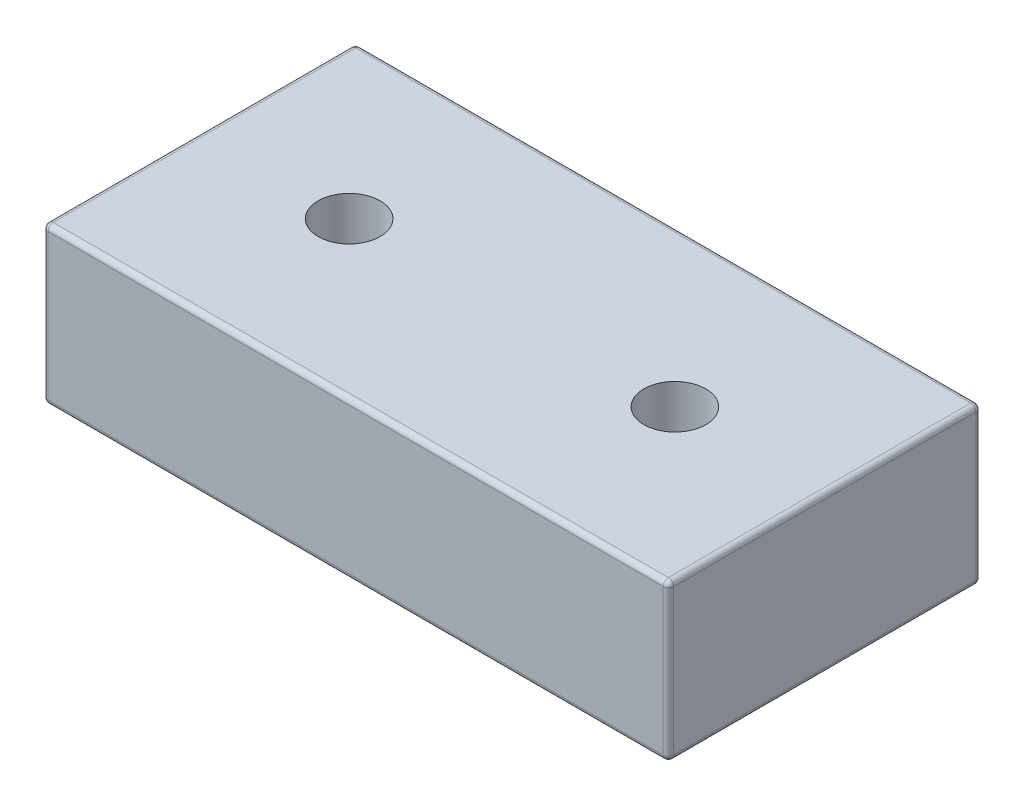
ISO-10303-21;
HEADER;
FILE_DESCRIPTION(('STEP AP214'),'2;1');
FILE_NAME('part.step','',(''),(''),'','','');
FILE_SCHEMA(('AUTOMOTIVE_DESIGN { 1 0 10303 214 1 1 1 1 }'));
ENDSEC;
DATA;
#1=APPLICATION_CONTEXT('core data for automotive mechanical design processes');
#2=APPLICATION_PROTOCOL_DEFINITION('international standard','automotive_design',2000,#1);
#3=PRODUCT_CONTEXT('',#1,'mechanical');
#4=PRODUCT('Part','Part','',(#3));
#5=PRODUCT_RELATED_PRODUCT_CATEGORY('part','',(#4));
#6=PRODUCT_DEFINITION_FORMATION('','',#4);
#7=PRODUCT_DEFINITION_CONTEXT('part definition',#1,'design');
#8=PRODUCT_DEFINITION('design','',#6,#7);
#9=PRODUCT_DEFINITION_SHAPE('','',#8);
#10=(LENGTH_UNIT() NAMED_UNIT(*) SI_UNIT(.MILLI.,.METRE.));
#11=(NAMED_UNIT(*) PLANE_ANGLE_UNIT() SI_UNIT($,.RADIAN.));
#12=(NAMED_UNIT(*) SI_UNIT($,.STERADIAN.) SOLID_ANGLE_UNIT());
#13=UNCERTAINTY_MEASURE_WITH_UNIT(LENGTH_MEASURE(1.E-05),#10,'distance_accuracy_value','');
#14=(GEOMETRIC_REPRESENTATION_CONTEXT(3) GLOBAL_UNCERTAINTY_ASSIGNED_CONTEXT((#13)) GLOBAL_UNIT_ASSIGNED_CONTEXT((#10,
#11,#12)) REPRESENTATION_CONTEXT('',''));
#15=CARTESIAN_POINT('',(0.,0.,0.));
#16=DIRECTION('',(0.,0.,1.));
#17=DIRECTION('',(1.,0.,0.));
#18=AXIS2_PLACEMENT_3D('',#15,#16,#17);
#19=CARTESIAN_POINT('',(304.8,76.2,-152.4));
#20=DIRECTION('',(-1.,0.,0.));
#21=DIRECTION('',(0.,0.,1.));
#22=AXIS2_PLACEMENT_3D('',#19,#20,#21);
#23=PLANE('',#22);
#24=DIRECTION('',(0.,0.,-1.));
#25=VECTOR('',#24,1.);
#26=CARTESIAN_POINT('',(304.8,-71.12,-152.4));
#27=LINE('',#26,#25);
#28=CARTESIAN_POINT('',(304.8,-71.12,147.32));
#29=VERTEX_POINT('',#28);
#30=CARTESIAN_POINT('',(304.8,-71.12,-147.32));
#31=VERTEX_POINT('',#30);
#32=EDGE_CURVE('E199',#29,#31,#27,.T.);
#33=ORIENTED_EDGE('',*,*,#32,.T.);
#34=DIRECTION('',(0.,-1.,0.));
#35=VECTOR('',#34,1.);
#36=CARTESIAN_POINT('',(304.8,76.2,-147.32));
#37=LINE('',#36,#35);
#38=CARTESIAN_POINT('',(304.8,71.12,-147.32));
#39=VERTEX_POINT('',#38);
#40=EDGE_CURVE('E45',#31,#39,#37,.F.);
#41=ORIENTED_EDGE('',*,*,#40,.T.);
#42=DIRECTION('',(0.,0.,-1.));
#43=VECTOR('',#42,1.);
#44=CARTESIAN_POINT('',(304.8,71.12,-152.4));
#45=LINE('',#44,#43);
#46=CARTESIAN_POINT('',(304.8,71.12,147.32));
#47=VERTEX_POINT('',#46);
#48=EDGE_CURVE('E174',#39,#47,#45,.F.);
#49=ORIENTED_EDGE('',*,*,#48,.T.);
#50=DIRECTION('',(0.,-1.,0.));
#51=VECTOR('',#50,1.);
#52=CARTESIAN_POINT('',(304.8,76.2,147.32));
#53=LINE('',#52,#51);
#54=EDGE_CURVE('E250',#47,#29,#53,.T.);
#55=ORIENTED_EDGE('',*,*,#54,.T.);
#56=EDGE_LOOP('',(#33,#41,#49,#55));
#57=FACE_BOUND('',#56,.T.);
#58=ADVANCED_FACE('F36',(#57),#23,.F.);
#59=CARTESIAN_POINT('',(304.8,76.2,-152.4));
#60=DIRECTION('',(0.,0.,1.));
#61=DIRECTION('',(1.,0.,0.));
#62=AXIS2_PLACEMENT_3D('',#59,#60,#61);
#63=PLANE('',#62);
#64=DIRECTION('',(-1.,0.,0.));
#65=VECTOR('',#64,1.);
#66=CARTESIAN_POINT('',(304.8,71.12,-152.4));
#67=LINE('',#66,#65);
#68=CARTESIAN_POINT('',(-299.72,71.12,-152.4));
#69=VERTEX_POINT('',#68);
#70=CARTESIAN_POINT('',(299.72,71.12,-152.4));
#71=VERTEX_POINT('',#70);
#72=EDGE_CURVE('E148',#69,#71,#67,.F.);
#73=ORIENTED_EDGE('',*,*,#72,.T.);
#74=DIRECTION('',(0.,-1.,0.));
#75=VECTOR('',#74,1.);
#76=CARTESIAN_POINT('',(299.72,76.2,-152.4));
#77=LINE('',#76,#75);
#78=CARTESIAN_POINT('',(299.72,-71.12,-152.4));
#79=VERTEX_POINT('',#78);
#80=EDGE_CURVE('E248',#71,#79,#77,.T.);
#81=ORIENTED_EDGE('',*,*,#80,.T.);
#82=DIRECTION('',(-1.,0.,0.));
#83=VECTOR('',#82,1.);
#84=CARTESIAN_POINT('',(-304.8,-71.12,-152.4));
#85=LINE('',#84,#83);
#86=CARTESIAN_POINT('',(-299.72,-71.12,-152.4));
#87=VERTEX_POINT('',#86);
#88=EDGE_CURVE('E149',#79,#87,#85,.T.);
#89=ORIENTED_EDGE('',*,*,#88,.T.);
#90=DIRECTION('',(0.,-1.,0.));
#91=VECTOR('',#90,1.);
#92=CARTESIAN_POINT('',(-299.72,76.2,-152.4));
#93=LINE('',#92,#91);
#94=EDGE_CURVE('E209',#87,#69,#93,.F.);
#95=ORIENTED_EDGE('',*,*,#94,.T.);
#96=EDGE_LOOP('',(#73,#81,#89,#95));
#97=FACE_BOUND('',#96,.T.);
#98=ADVANCED_FACE('F342',(#97),#63,.F.);
#99=CARTESIAN_POINT('',(-304.8,76.2,-152.4));
#100=DIRECTION('',(1.,0.,0.));
#101=DIRECTION('',(0.,0.,-1.));
#102=AXIS2_PLACEMENT_3D('',#99,#100,#101);
#103=PLANE('',#102);
#104=DIRECTION('',(0.,0.,1.));
#105=VECTOR('',#104,1.);
#106=CARTESIAN_POINT('',(-304.8,-71.12,152.4));
#107=LINE('',#106,#105);
#108=CARTESIAN_POINT('',(-304.8,-71.12,-147.32));
#109=VERTEX_POINT('',#108);
#110=CARTESIAN_POINT('',(-304.8,-71.12,147.32));
#111=VERTEX_POINT('',#110);
#112=EDGE_CURVE('E182',#109,#111,#107,.T.);
#113=ORIENTED_EDGE('',*,*,#112,.T.);
#114=DIRECTION('',(0.,-1.,0.));
#115=VECTOR('',#114,1.);
#116=CARTESIAN_POINT('',(-304.8,76.2,147.32));
#117=LINE('',#116,#115);
#118=CARTESIAN_POINT('',(-304.8,71.12,147.32));
#119=VERTEX_POINT('',#118);
#120=EDGE_CURVE('E223',#111,#119,#117,.F.);
#121=ORIENTED_EDGE('',*,*,#120,.T.);
#122=DIRECTION('',(0.,0.,1.));
#123=VECTOR('',#122,1.);
#124=CARTESIAN_POINT('',(-304.8,71.12,-152.4));
#125=LINE('',#124,#123);
#126=CARTESIAN_POINT('',(-304.8,71.12,-147.32));
#127=VERTEX_POINT('',#126);
#128=EDGE_CURVE('E180',#119,#127,#125,.F.);
#129=ORIENTED_EDGE('',*,*,#128,.T.);
#130=DIRECTION('',(0.,-1.,0.));
#131=VECTOR('',#130,1.);
#132=CARTESIAN_POINT('',(-304.8,76.2,-147.32));
#133=LINE('',#132,#131);
#134=EDGE_CURVE('E207',#127,#109,#133,.T.);
#135=ORIENTED_EDGE('',*,*,#134,.T.);
#136=EDGE_LOOP('',(#113,#121,#129,#135));
#137=FACE_BOUND('',#136,.T.);
#138=ADVANCED_FACE('F310',(#137),#103,.F.);
#139=CARTESIAN_POINT('',(304.8,76.2,152.4));
#140=DIRECTION('',(0.,0.,-1.));
#141=DIRECTION('',(-1.,0.,0.));
#142=AXIS2_PLACEMENT_3D('',#139,#140,#141);
#143=PLANE('',#142);
#144=DIRECTION('',(1.,0.,0.));
#145=VECTOR('',#144,1.);
#146=CARTESIAN_POINT('',(304.8,-71.12,152.4));
#147=LINE('',#146,#145);
#148=CARTESIAN_POINT('',(-299.72,-71.12,152.4));
#149=VERTEX_POINT('',#148);
#150=CARTESIAN_POINT('',(299.72,-71.12,152.4));
#151=VERTEX_POINT('',#150);
#152=EDGE_CURVE('E197',#149,#151,#147,.T.);
#153=ORIENTED_EDGE('',*,*,#152,.T.);
#154=DIRECTION('',(0.,-1.,0.));
#155=VECTOR('',#154,1.);
#156=CARTESIAN_POINT('',(299.72,76.2,152.4));
#157=LINE('',#156,#155);
#158=CARTESIAN_POINT('',(299.72,71.12,152.4));
#159=VERTEX_POINT('',#158);
#160=EDGE_CURVE('E11',#151,#159,#157,.F.);
#161=ORIENTED_EDGE('',*,*,#160,.T.);
#162=DIRECTION('',(1.,0.,0.));
#163=VECTOR('',#162,1.);
#164=CARTESIAN_POINT('',(304.8,71.12,152.4));
#165=LINE('',#164,#163);
#166=CARTESIAN_POINT('',(-299.72,71.12,152.4));
#167=VERTEX_POINT('',#166);
#168=EDGE_CURVE('E177',#159,#167,#165,.F.);
#169=ORIENTED_EDGE('',*,*,#168,.T.);
#170=DIRECTION('',(0.,-1.,0.));
#171=VECTOR('',#170,1.);
#172=CARTESIAN_POINT('',(-299.72,76.2,152.4));
#173=LINE('',#172,#171);
#174=EDGE_CURVE('E221',#167,#149,#173,.T.);
#175=ORIENTED_EDGE('',*,*,#174,.T.);
#176=EDGE_LOOP('',(#153,#161,#169,#175));
#177=FACE_BOUND('',#176,.T.);
#178=ADVANCED_FACE('F404',(#177),#143,.F.);
#179=CARTESIAN_POINT('',(304.8,76.2,-152.4));
#180=DIRECTION('',(0.,-1.,0.));
#181=DIRECTION('',(0.,0.,-1.));
#182=AXIS2_PLACEMENT_3D('',#179,#180,#181);
#183=PLANE('',#182);
#184=CARTESIAN_POINT('',(158.75,76.2,0.));
#185=DIRECTION('',(0.,-1.,0.));
#186=DIRECTION('',(0.,0.,-1.));
#187=AXIS2_PLACEMENT_3D('',#184,#185,#186);
#188=CIRCLE('',#187,30.226);
#189=CARTESIAN_POINT('',(158.75,76.2,-30.226));
#190=VERTEX_POINT('',#189);
#191=EDGE_CURVE('E269',#190,#190,#188,.T.);
#192=ORIENTED_EDGE('',*,*,#191,.T.);
#193=EDGE_LOOP('',(#192));
#194=FACE_BOUND('',#193,.T.);
#195=CARTESIAN_POINT('',(-158.75,76.2,0.));
#196=DIRECTION('',(0.,-1.,0.));
#197=DIRECTION('',(0.,0.,-1.));
#198=AXIS2_PLACEMENT_3D('',#195,#196,#197);
#199=CIRCLE('',#198,30.226);
#200=CARTESIAN_POINT('',(-158.75,76.2,-30.226));
#201=VERTEX_POINT('',#200);
#202=EDGE_CURVE('E258',#201,#201,#199,.T.);
#203=ORIENTED_EDGE('',*,*,#202,.T.);
#204=EDGE_LOOP('',(#203));
#205=FACE_BOUND('',#204,.T.);
#206=DIRECTION('',(1.,0.,0.));
#207=VECTOR('',#206,1.);
#208=CARTESIAN_POINT('',(304.8,76.2,147.32));
#209=LINE('',#208,#207);
#210=CARTESIAN_POINT('',(-299.72,76.2,147.32));
#211=VERTEX_POINT('',#210);
#212=CARTESIAN_POINT('',(299.72,76.2,147.32));
#213=VERTEX_POINT('',#212);
#214=EDGE_CURVE('E159',#211,#213,#209,.T.);
#215=ORIENTED_EDGE('',*,*,#214,.T.);
#216=DIRECTION('',(0.,0.,-1.));
#217=VECTOR('',#216,1.);
#218=CARTESIAN_POINT('',(299.72,76.2,-152.4));
#219=LINE('',#218,#217);
#220=CARTESIAN_POINT('',(299.72,76.2,-147.32));
#221=VERTEX_POINT('',#220);
#222=EDGE_CURVE('E158',#213,#221,#219,.T.);
#223=ORIENTED_EDGE('',*,*,#222,.T.);
#224=DIRECTION('',(-1.,0.,0.));
#225=VECTOR('',#224,1.);
#226=CARTESIAN_POINT('',(304.8,76.2,-147.32));
#227=LINE('',#226,#225);
#228=CARTESIAN_POINT('',(-299.72,76.2,-147.32));
#229=VERTEX_POINT('',#228);
#230=EDGE_CURVE('E145',#221,#229,#227,.T.);
#231=ORIENTED_EDGE('',*,*,#230,.T.);
#232=DIRECTION('',(0.,0.,1.));
#233=VECTOR('',#232,1.);
#234=CARTESIAN_POINT('',(-299.72,76.2,-152.4));
#235=LINE('',#234,#233);
#236=EDGE_CURVE('E155',#229,#211,#235,.T.);
#237=ORIENTED_EDGE('',*,*,#236,.T.);
#238=EDGE_LOOP('',(#215,#223,#231,#237));
#239=FACE_BOUND('',#238,.T.);
#240=ADVANCED_FACE('F154',(#194,#205,#239),#183,.F.);
#241=CARTESIAN_POINT('',(304.8,-76.2,-152.4));
#242=DIRECTION('',(0.,-1.,0.));
#243=DIRECTION('',(0.,0.,-1.));
#244=AXIS2_PLACEMENT_3D('',#241,#242,#243);
#245=PLANE('',#244);
#246=CARTESIAN_POINT('',(158.75,-76.2,0.));
#247=DIRECTION('',(0.,-1.,0.));
#248=DIRECTION('',(0.,0.,-1.));
#249=AXIS2_PLACEMENT_3D('',#246,#247,#248);
#250=CIRCLE('',#249,30.226);
#251=CARTESIAN_POINT('',(158.75,-76.2,-30.226));
#252=VERTEX_POINT('',#251);
#253=EDGE_CURVE('E271',#252,#252,#250,.T.);
#254=ORIENTED_EDGE('',*,*,#253,.F.);
#255=EDGE_LOOP('',(#254));
#256=FACE_BOUND('',#255,.T.);
#257=CARTESIAN_POINT('',(-158.75,-76.2,0.));
#258=DIRECTION('',(0.,-1.,0.));
#259=DIRECTION('',(0.,0.,-1.));
#260=AXIS2_PLACEMENT_3D('',#257,#258,#259);
#261=CIRCLE('',#260,30.226);
#262=CARTESIAN_POINT('',(-158.75,-76.2,-30.226));
#263=VERTEX_POINT('',#262);
#264=EDGE_CURVE('E169',#263,#263,#261,.T.);
#265=ORIENTED_EDGE('',*,*,#264,.F.);
#266=EDGE_LOOP('',(#265));
#267=FACE_BOUND('',#266,.T.);
#268=DIRECTION('',(1.,0.,0.));
#269=VECTOR('',#268,1.);
#270=CARTESIAN_POINT('',(-304.8,-76.2,147.32));
#271=LINE('',#270,#269);
#272=CARTESIAN_POINT('',(299.72,-76.2,147.32));
#273=VERTEX_POINT('',#272);
#274=CARTESIAN_POINT('',(-299.72,-76.2,147.32));
#275=VERTEX_POINT('',#274);
#276=EDGE_CURVE('E191',#273,#275,#271,.F.);
#277=ORIENTED_EDGE('',*,*,#276,.T.);
#278=DIRECTION('',(0.,0.,1.));
#279=VECTOR('',#278,1.);
#280=CARTESIAN_POINT('',(-299.72,-76.2,-152.4));
#281=LINE('',#280,#279);
#282=CARTESIAN_POINT('',(-299.72,-76.2,-147.32));
#283=VERTEX_POINT('',#282);
#284=EDGE_CURVE('E194',#275,#283,#281,.F.);
#285=ORIENTED_EDGE('',*,*,#284,.T.);
#286=DIRECTION('',(-1.,0.,0.));
#287=VECTOR('',#286,1.);
#288=CARTESIAN_POINT('',(304.8,-76.2,-147.32));
#289=LINE('',#288,#287);
#290=CARTESIAN_POINT('',(299.72,-76.2,-147.32));
#291=VERTEX_POINT('',#290);
#292=EDGE_CURVE('E185',#283,#291,#289,.F.);
#293=ORIENTED_EDGE('',*,*,#292,.T.);
#294=DIRECTION('',(0.,0.,-1.));
#295=VECTOR('',#294,1.);
#296=CARTESIAN_POINT('',(299.72,-76.2,152.4));
#297=LINE('',#296,#295);
#298=EDGE_CURVE('E188',#291,#273,#297,.F.);
#299=ORIENTED_EDGE('',*,*,#298,.T.);
#300=EDGE_LOOP('',(#277,#285,#293,#299));
#301=FACE_BOUND('',#300,.T.);
#302=ADVANCED_FACE('F285',(#256,#267,#301),#245,.T.);
#303=CARTESIAN_POINT('',(-299.72,71.12,-152.4));
#304=DIRECTION('',(0.,0.,1.));
#305=DIRECTION('',(1.,0.,0.));
#306=AXIS2_PLACEMENT_3D('',#303,#304,#305);
#307=CYLINDRICAL_SURFACE('',#306,5.08);
#308=ORIENTED_EDGE('',*,*,#128,.F.);
#309=CARTESIAN_POINT('',(-299.72,71.12,147.32));
#310=DIRECTION('',(0.,0.,1.));
#311=DIRECTION('',(1.,0.,0.));
#312=AXIS2_PLACEMENT_3D('',#309,#310,#311);
#313=CIRCLE('',#312,5.08);
#314=EDGE_CURVE('E163',#119,#211,#313,.F.);
#315=ORIENTED_EDGE('',*,*,#314,.T.);
#316=ORIENTED_EDGE('',*,*,#236,.F.);
#317=CARTESIAN_POINT('',(-299.72,71.12,-147.32));
#318=DIRECTION('',(0.,0.,1.));
#319=DIRECTION('',(1.,0.,0.));
#320=AXIS2_PLACEMENT_3D('',#317,#318,#319);
#321=CIRCLE('',#320,5.08);
#322=EDGE_CURVE('E128',#229,#127,#321,.T.);
#323=ORIENTED_EDGE('',*,*,#322,.T.);
#324=EDGE_LOOP('',(#308,#315,#316,#323));
#325=FACE_BOUND('',#324,.T.);
#326=ADVANCED_FACE('F161',(#325),#307,.T.);
#327=CARTESIAN_POINT('',(304.8,71.12,147.32));
#328=DIRECTION('',(1.,0.,0.));
#329=DIRECTION('',(0.,0.,-1.));
#330=AXIS2_PLACEMENT_3D('',#327,#328,#329);
#331=CYLINDRICAL_SURFACE('',#330,5.08);
#332=ORIENTED_EDGE('',*,*,#168,.F.);
#333=CARTESIAN_POINT('',(299.72,71.12,147.32));
#334=DIRECTION('',(1.,0.,0.));
#335=DIRECTION('',(0.,0.,-1.));
#336=AXIS2_PLACEMENT_3D('',#333,#334,#335);
#337=CIRCLE('',#336,5.08);
#338=EDGE_CURVE('E245',#159,#213,#337,.F.);
#339=ORIENTED_EDGE('',*,*,#338,.T.);
#340=ORIENTED_EDGE('',*,*,#214,.F.);
#341=CARTESIAN_POINT('',(-299.72,71.12,147.32));
#342=DIRECTION('',(1.,0.,0.));
#343=DIRECTION('',(0.,0.,-1.));
#344=AXIS2_PLACEMENT_3D('',#341,#342,#343);
#345=CIRCLE('',#344,5.08);
#346=EDGE_CURVE('E211',#211,#167,#345,.T.);
#347=ORIENTED_EDGE('',*,*,#346,.T.);
#348=EDGE_LOOP('',(#332,#339,#340,#347));
#349=FACE_BOUND('',#348,.T.);
#350=ADVANCED_FACE('F315',(#349),#331,.T.);
#351=CARTESIAN_POINT('',(304.8,71.12,-147.32));
#352=DIRECTION('',(-1.,0.,0.));
#353=DIRECTION('',(0.,0.,1.));
#354=AXIS2_PLACEMENT_3D('',#351,#352,#353);
#355=CYLINDRICAL_SURFACE('',#354,5.08);
#356=ORIENTED_EDGE('',*,*,#230,.F.);
#357=CARTESIAN_POINT('',(299.72,71.12,-147.32));
#358=DIRECTION('',(-1.,0.,0.));
#359=DIRECTION('',(0.,0.,1.));
#360=AXIS2_PLACEMENT_3D('',#357,#358,#359);
#361=CIRCLE('',#360,5.08);
#362=EDGE_CURVE('E237',#221,#71,#361,.T.);
#363=ORIENTED_EDGE('',*,*,#362,.T.);
#364=ORIENTED_EDGE('',*,*,#72,.F.);
#365=CARTESIAN_POINT('',(-299.72,71.12,-147.32));
#366=DIRECTION('',(-1.,0.,0.));
#367=DIRECTION('',(0.,0.,1.));
#368=AXIS2_PLACEMENT_3D('',#365,#366,#367);
#369=CIRCLE('',#368,5.08);
#370=EDGE_CURVE('E131',#69,#229,#369,.F.);
#371=ORIENTED_EDGE('',*,*,#370,.T.);
#372=EDGE_LOOP('',(#356,#363,#364,#371));
#373=FACE_BOUND('',#372,.T.);
#374=ADVANCED_FACE('F144',(#373),#355,.T.);
#375=CARTESIAN_POINT('',(299.72,71.12,-152.4));
#376=DIRECTION('',(0.,0.,-1.));
#377=DIRECTION('',(-1.,0.,0.));
#378=AXIS2_PLACEMENT_3D('',#375,#376,#377);
#379=CYLINDRICAL_SURFACE('',#378,5.08);
#380=ORIENTED_EDGE('',*,*,#48,.F.);
#381=CARTESIAN_POINT('',(299.72,71.12,-147.32));
#382=DIRECTION('',(0.,0.,-1.));
#383=DIRECTION('',(-1.,0.,0.));
#384=AXIS2_PLACEMENT_3D('',#381,#382,#383);
#385=CIRCLE('',#384,5.08);
#386=EDGE_CURVE('E234',#39,#221,#385,.F.);
#387=ORIENTED_EDGE('',*,*,#386,.T.);
#388=ORIENTED_EDGE('',*,*,#222,.F.);
#389=CARTESIAN_POINT('',(299.72,71.12,147.32));
#390=DIRECTION('',(0.,0.,-1.));
#391=DIRECTION('',(-1.,0.,0.));
#392=AXIS2_PLACEMENT_3D('',#389,#390,#391);
#393=CIRCLE('',#392,5.08);
#394=EDGE_CURVE('E225',#213,#47,#393,.T.);
#395=ORIENTED_EDGE('',*,*,#394,.T.);
#396=EDGE_LOOP('',(#380,#387,#388,#395));
#397=FACE_BOUND('',#396,.T.);
#398=ADVANCED_FACE('F318',(#397),#379,.T.);
#399=CARTESIAN_POINT('',(299.72,-71.12,-152.4));
#400=DIRECTION('',(0.,0.,1.));
#401=DIRECTION('',(1.,0.,0.));
#402=AXIS2_PLACEMENT_3D('',#399,#400,#401);
#403=CYLINDRICAL_SURFACE('',#402,5.08);
#404=ORIENTED_EDGE('',*,*,#298,.F.);
#405=CARTESIAN_POINT('',(299.72,-71.12,-147.32));
#406=DIRECTION('',(0.,0.,1.));
#407=DIRECTION('',(1.,0.,0.));
#408=AXIS2_PLACEMENT_3D('',#405,#406,#407);
#409=CIRCLE('',#408,5.08);
#410=EDGE_CURVE('E243',#291,#31,#409,.T.);
#411=ORIENTED_EDGE('',*,*,#410,.T.);
#412=ORIENTED_EDGE('',*,*,#32,.F.);
#413=CARTESIAN_POINT('',(299.72,-71.12,147.32));
#414=DIRECTION('',(0.,0.,1.));
#415=DIRECTION('',(1.,0.,0.));
#416=AXIS2_PLACEMENT_3D('',#413,#414,#415);
#417=CIRCLE('',#416,5.08);
#418=EDGE_CURVE('E241',#29,#273,#417,.F.);
#419=ORIENTED_EDGE('',*,*,#418,.T.);
#420=EDGE_LOOP('',(#404,#411,#412,#419));
#421=FACE_BOUND('',#420,.T.);
#422=ADVANCED_FACE('F329',(#421),#403,.T.);
#423=CARTESIAN_POINT('',(304.8,-71.12,-147.32));
#424=DIRECTION('',(1.,0.,0.));
#425=DIRECTION('',(0.,0.,-1.));
#426=AXIS2_PLACEMENT_3D('',#423,#424,#425);
#427=CYLINDRICAL_SURFACE('',#426,5.08);
#428=ORIENTED_EDGE('',*,*,#88,.F.);
#429=CARTESIAN_POINT('',(299.72,-71.12,-147.32));
#430=DIRECTION('',(1.,0.,0.));
#431=DIRECTION('',(0.,0.,-1.));
#432=AXIS2_PLACEMENT_3D('',#429,#430,#431);
#433=CIRCLE('',#432,5.08);
#434=EDGE_CURVE('E239',#79,#291,#433,.F.);
#435=ORIENTED_EDGE('',*,*,#434,.T.);
#436=ORIENTED_EDGE('',*,*,#292,.F.);
#437=CARTESIAN_POINT('',(-299.72,-71.12,-147.32));
#438=DIRECTION('',(1.,0.,0.));
#439=DIRECTION('',(0.,0.,-1.));
#440=AXIS2_PLACEMENT_3D('',#437,#438,#439);
#441=CIRCLE('',#440,5.08);
#442=EDGE_CURVE('E204',#283,#87,#441,.T.);
#443=ORIENTED_EDGE('',*,*,#442,.T.);
#444=EDGE_LOOP('',(#428,#435,#436,#443));
#445=FACE_BOUND('',#444,.T.);
#446=ADVANCED_FACE('F365',(#445),#427,.T.);
#447=CARTESIAN_POINT('',(304.8,-71.12,147.32));
#448=DIRECTION('',(-1.,0.,0.));
#449=DIRECTION('',(0.,0.,1.));
#450=AXIS2_PLACEMENT_3D('',#447,#448,#449);
#451=CYLINDRICAL_SURFACE('',#450,5.08);
#452=ORIENTED_EDGE('',*,*,#276,.F.);
#453=CARTESIAN_POINT('',(299.72,-71.12,147.32));
#454=DIRECTION('',(-1.,0.,0.));
#455=DIRECTION('',(0.,0.,1.));
#456=AXIS2_PLACEMENT_3D('',#453,#454,#455);
#457=CIRCLE('',#456,5.08);
#458=EDGE_CURVE('E53',#273,#151,#457,.T.);
#459=ORIENTED_EDGE('',*,*,#458,.T.);
#460=ORIENTED_EDGE('',*,*,#152,.F.);
#461=CARTESIAN_POINT('',(-299.72,-71.12,147.32));
#462=DIRECTION('',(-1.,0.,0.));
#463=DIRECTION('',(0.,0.,1.));
#464=AXIS2_PLACEMENT_3D('',#461,#462,#463);
#465=CIRCLE('',#464,5.08);
#466=EDGE_CURVE('E219',#149,#275,#465,.F.);
#467=ORIENTED_EDGE('',*,*,#466,.T.);
#468=EDGE_LOOP('',(#452,#459,#460,#467));
#469=FACE_BOUND('',#468,.T.);
#470=ADVANCED_FACE('F362',(#469),#451,.T.);
#471=CARTESIAN_POINT('',(-299.72,-71.12,-152.4));
#472=DIRECTION('',(0.,0.,-1.));
#473=DIRECTION('',(-1.,0.,0.));
#474=AXIS2_PLACEMENT_3D('',#471,#472,#473);
#475=CYLINDRICAL_SURFACE('',#474,5.08);
#476=ORIENTED_EDGE('',*,*,#284,.F.);
#477=CARTESIAN_POINT('',(-299.72,-71.12,147.32));
#478=DIRECTION('',(0.,0.,-1.));
#479=DIRECTION('',(-1.,0.,0.));
#480=AXIS2_PLACEMENT_3D('',#477,#478,#479);
#481=CIRCLE('',#480,5.08);
#482=EDGE_CURVE('E217',#275,#111,#481,.T.);
#483=ORIENTED_EDGE('',*,*,#482,.T.);
#484=ORIENTED_EDGE('',*,*,#112,.F.);
#485=CARTESIAN_POINT('',(-299.72,-71.12,-147.32));
#486=DIRECTION('',(0.,0.,-1.));
#487=DIRECTION('',(-1.,0.,0.));
#488=AXIS2_PLACEMENT_3D('',#485,#486,#487);
#489=CIRCLE('',#488,5.08);
#490=EDGE_CURVE('E138',#109,#283,#489,.F.);
#491=ORIENTED_EDGE('',*,*,#490,.T.);
#492=EDGE_LOOP('',(#476,#483,#484,#491));
#493=FACE_BOUND('',#492,.T.);
#494=ADVANCED_FACE('F296',(#493),#475,.T.);
#495=CARTESIAN_POINT('',(-299.72,-71.12,-147.32));
#496=DIRECTION('',(0.,0.,1.));
#497=DIRECTION('',(1.,0.,0.));
#498=AXIS2_PLACEMENT_3D('',#495,#496,#497);
#499=SPHERICAL_SURFACE('',#498,5.08);
#500=ORIENTED_EDGE('',*,*,#442,.F.);
#501=ORIENTED_EDGE('',*,*,#490,.F.);
#502=CARTESIAN_POINT('',(-299.72,-71.12,-147.32));
#503=DIRECTION('',(0.,1.,0.));
#504=DIRECTION('',(0.,0.,1.));
#505=AXIS2_PLACEMENT_3D('',#502,#503,#504);
#506=CIRCLE('',#505,5.08);
#507=EDGE_CURVE('E164',#87,#109,#506,.T.);
#508=ORIENTED_EDGE('',*,*,#507,.F.);
#509=EDGE_LOOP('',(#500,#501,#508));
#510=FACE_BOUND('',#509,.T.);
#511=ADVANCED_FACE('F361',(#510),#499,.T.);
#512=CARTESIAN_POINT('',(-299.72,76.2,-147.32));
#513=DIRECTION('',(0.,-1.,0.));
#514=DIRECTION('',(0.,0.,-1.));
#515=AXIS2_PLACEMENT_3D('',#512,#513,#514);
#516=CYLINDRICAL_SURFACE('',#515,5.08);
#517=ORIENTED_EDGE('',*,*,#507,.T.);
#518=ORIENTED_EDGE('',*,*,#134,.F.);
#519=CARTESIAN_POINT('',(-299.72,71.12,-147.32));
#520=DIRECTION('',(0.,1.,0.));
#521=DIRECTION('',(0.,0.,1.));
#522=AXIS2_PLACEMENT_3D('',#519,#520,#521);
#523=CIRCLE('',#522,5.08);
#524=EDGE_CURVE('E133',#69,#127,#523,.T.);
#525=ORIENTED_EDGE('',*,*,#524,.F.);
#526=ORIENTED_EDGE('',*,*,#94,.F.);
#527=EDGE_LOOP('',(#517,#518,#525,#526));
#528=FACE_BOUND('',#527,.T.);
#529=ADVANCED_FACE('F373',(#528),#516,.T.);
#530=CARTESIAN_POINT('',(-299.72,71.12,-147.32));
#531=DIRECTION('',(0.,0.,1.));
#532=DIRECTION('',(1.,0.,0.));
#533=AXIS2_PLACEMENT_3D('',#530,#531,#532);
#534=SPHERICAL_SURFACE('',#533,5.08);
#535=ORIENTED_EDGE('',*,*,#524,.T.);
#536=ORIENTED_EDGE('',*,*,#322,.F.);
#537=ORIENTED_EDGE('',*,*,#370,.F.);
#538=EDGE_LOOP('',(#535,#536,#537));
#539=FACE_BOUND('',#538,.T.);
#540=ADVANCED_FACE('F130',(#539),#534,.T.);
#541=CARTESIAN_POINT('',(-299.72,-71.12,147.32));
#542=DIRECTION('',(0.,0.,1.));
#543=DIRECTION('',(1.,0.,0.));
#544=AXIS2_PLACEMENT_3D('',#541,#542,#543);
#545=SPHERICAL_SURFACE('',#544,5.08);
#546=ORIENTED_EDGE('',*,*,#482,.F.);
#547=ORIENTED_EDGE('',*,*,#466,.F.);
#548=CARTESIAN_POINT('',(-299.72,-71.12,147.32));
#549=DIRECTION('',(0.,1.,0.));
#550=DIRECTION('',(0.,0.,1.));
#551=AXIS2_PLACEMENT_3D('',#548,#549,#550);
#552=CIRCLE('',#551,5.08);
#553=EDGE_CURVE('E212',#111,#149,#552,.T.);
#554=ORIENTED_EDGE('',*,*,#553,.F.);
#555=EDGE_LOOP('',(#546,#547,#554));
#556=FACE_BOUND('',#555,.T.);
#557=ADVANCED_FACE('F303',(#556),#545,.T.);
#558=CARTESIAN_POINT('',(-299.72,76.2,147.32));
#559=DIRECTION('',(0.,-1.,0.));
#560=DIRECTION('',(0.,0.,-1.));
#561=AXIS2_PLACEMENT_3D('',#558,#559,#560);
#562=CYLINDRICAL_SURFACE('',#561,5.08);
#563=ORIENTED_EDGE('',*,*,#553,.T.);
#564=ORIENTED_EDGE('',*,*,#174,.F.);
#565=CARTESIAN_POINT('',(-299.72,71.12,147.32));
#566=DIRECTION('',(0.,1.,0.));
#567=DIRECTION('',(0.,0.,1.));
#568=AXIS2_PLACEMENT_3D('',#565,#566,#567);
#569=CIRCLE('',#568,5.08);
#570=EDGE_CURVE('E226',#119,#167,#569,.T.);
#571=ORIENTED_EDGE('',*,*,#570,.F.);
#572=ORIENTED_EDGE('',*,*,#120,.F.);
#573=EDGE_LOOP('',(#563,#564,#571,#572));
#574=FACE_BOUND('',#573,.T.);
#575=ADVANCED_FACE('F308',(#574),#562,.T.);
#576=CARTESIAN_POINT('',(-299.72,71.12,147.32));
#577=DIRECTION('',(0.,0.,1.));
#578=DIRECTION('',(1.,0.,0.));
#579=AXIS2_PLACEMENT_3D('',#576,#577,#578);
#580=SPHERICAL_SURFACE('',#579,5.08);
#581=ORIENTED_EDGE('',*,*,#346,.F.);
#582=ORIENTED_EDGE('',*,*,#314,.F.);
#583=ORIENTED_EDGE('',*,*,#570,.T.);
#584=EDGE_LOOP('',(#581,#582,#583));
#585=FACE_BOUND('',#584,.T.);
#586=ADVANCED_FACE('F313',(#585),#580,.T.);
#587=CARTESIAN_POINT('',(299.72,-71.12,-147.32));
#588=DIRECTION('',(0.,0.,1.));
#589=DIRECTION('',(1.,0.,0.));
#590=AXIS2_PLACEMENT_3D('',#587,#588,#589);
#591=SPHERICAL_SURFACE('',#590,5.08);
#592=ORIENTED_EDGE('',*,*,#410,.F.);
#593=ORIENTED_EDGE('',*,*,#434,.F.);
#594=CARTESIAN_POINT('',(299.72,-71.12,-147.32));
#595=DIRECTION('',(0.,1.,0.));
#596=DIRECTION('',(0.,0.,1.));
#597=AXIS2_PLACEMENT_3D('',#594,#595,#596);
#598=CIRCLE('',#597,5.08);
#599=EDGE_CURVE('E229',#31,#79,#598,.T.);
#600=ORIENTED_EDGE('',*,*,#599,.F.);
#601=EDGE_LOOP('',(#592,#593,#600));
#602=FACE_BOUND('',#601,.T.);
#603=ADVANCED_FACE('F382',(#602),#591,.T.);
#604=CARTESIAN_POINT('',(299.72,76.2,-147.32));
#605=DIRECTION('',(0.,-1.,0.));
#606=DIRECTION('',(0.,0.,-1.));
#607=AXIS2_PLACEMENT_3D('',#604,#605,#606);
#608=CYLINDRICAL_SURFACE('',#607,5.08);
#609=ORIENTED_EDGE('',*,*,#599,.T.);
#610=ORIENTED_EDGE('',*,*,#80,.F.);
#611=CARTESIAN_POINT('',(299.72,71.12,-147.32));
#612=DIRECTION('',(0.,1.,0.));
#613=DIRECTION('',(0.,0.,1.));
#614=AXIS2_PLACEMENT_3D('',#611,#612,#613);
#615=CIRCLE('',#614,5.08);
#616=EDGE_CURVE('E253',#39,#71,#615,.T.);
#617=ORIENTED_EDGE('',*,*,#616,.F.);
#618=ORIENTED_EDGE('',*,*,#40,.F.);
#619=EDGE_LOOP('',(#609,#610,#617,#618));
#620=FACE_BOUND('',#619,.T.);
#621=ADVANCED_FACE('F338',(#620),#608,.T.);
#622=CARTESIAN_POINT('',(299.72,71.12,-147.32));
#623=DIRECTION('',(0.,0.,1.));
#624=DIRECTION('',(1.,0.,0.));
#625=AXIS2_PLACEMENT_3D('',#622,#623,#624);
#626=SPHERICAL_SURFACE('',#625,5.08);
#627=ORIENTED_EDGE('',*,*,#616,.T.);
#628=ORIENTED_EDGE('',*,*,#362,.F.);
#629=ORIENTED_EDGE('',*,*,#386,.F.);
#630=EDGE_LOOP('',(#627,#628,#629));
#631=FACE_BOUND('',#630,.T.);
#632=ADVANCED_FACE('F333',(#631),#626,.T.);
#633=CARTESIAN_POINT('',(299.72,-71.12,147.32));
#634=DIRECTION('',(0.,0.,1.));
#635=DIRECTION('',(1.,0.,0.));
#636=AXIS2_PLACEMENT_3D('',#633,#634,#635);
#637=SPHERICAL_SURFACE('',#636,5.08);
#638=ORIENTED_EDGE('',*,*,#458,.F.);
#639=ORIENTED_EDGE('',*,*,#418,.F.);
#640=CARTESIAN_POINT('',(299.72,-71.12,147.32));
#641=DIRECTION('',(0.,1.,0.));
#642=DIRECTION('',(0.,0.,1.));
#643=AXIS2_PLACEMENT_3D('',#640,#641,#642);
#644=CIRCLE('',#643,5.08);
#645=EDGE_CURVE('E40',#151,#29,#644,.T.);
#646=ORIENTED_EDGE('',*,*,#645,.F.);
#647=EDGE_LOOP('',(#638,#639,#646));
#648=FACE_BOUND('',#647,.T.);
#649=ADVANCED_FACE('F38',(#648),#637,.T.);
#650=CARTESIAN_POINT('',(299.72,76.2,147.32));
#651=DIRECTION('',(0.,-1.,0.));
#652=DIRECTION('',(0.,0.,-1.));
#653=AXIS2_PLACEMENT_3D('',#650,#651,#652);
#654=CYLINDRICAL_SURFACE('',#653,5.08);
#655=ORIENTED_EDGE('',*,*,#645,.T.);
#656=ORIENTED_EDGE('',*,*,#54,.F.);
#657=CARTESIAN_POINT('',(299.72,71.12,147.32));
#658=DIRECTION('',(0.,1.,0.));
#659=DIRECTION('',(0.,0.,1.));
#660=AXIS2_PLACEMENT_3D('',#657,#658,#659);
#661=CIRCLE('',#660,5.08);
#662=EDGE_CURVE('E257',#159,#47,#661,.T.);
#663=ORIENTED_EDGE('',*,*,#662,.F.);
#664=ORIENTED_EDGE('',*,*,#160,.F.);
#665=EDGE_LOOP('',(#655,#656,#663,#664));
#666=FACE_BOUND('',#665,.T.);
#667=ADVANCED_FACE('F322',(#666),#654,.T.);
#668=CARTESIAN_POINT('',(299.72,71.12,147.32));
#669=DIRECTION('',(0.,0.,1.));
#670=DIRECTION('',(1.,0.,0.));
#671=AXIS2_PLACEMENT_3D('',#668,#669,#670);
#672=SPHERICAL_SURFACE('',#671,5.08);
#673=ORIENTED_EDGE('',*,*,#394,.F.);
#674=ORIENTED_EDGE('',*,*,#338,.F.);
#675=ORIENTED_EDGE('',*,*,#662,.T.);
#676=EDGE_LOOP('',(#673,#674,#675));
#677=FACE_BOUND('',#676,.T.);
#678=ADVANCED_FACE('F320',(#677),#672,.T.);
#679=CARTESIAN_POINT('',(-158.75,76.2,0.));
#680=DIRECTION('',(0.,-1.,0.));
#681=DIRECTION('',(0.,0.,-1.));
#682=AXIS2_PLACEMENT_3D('',#679,#680,#681);
#683=CYLINDRICAL_SURFACE('',#682,30.226);
#684=CARTESIAN_POINT('',(-158.75,76.2,-30.226));
#685=CARTESIAN_POINT('',(-158.75,74.6125,-30.226));
#686=CARTESIAN_POINT('',(-158.75,73.025,-30.226));
#687=CARTESIAN_POINT('',(-158.75,69.85,-30.226));
#688=CARTESIAN_POINT('',(-158.75,68.2625,-30.226));
#689=CARTESIAN_POINT('',(-158.75,65.0875,-30.226));
#690=CARTESIAN_POINT('',(-158.75,63.5,-30.226));
#691=CARTESIAN_POINT('',(-158.75,60.325,-30.226));
#692=CARTESIAN_POINT('',(-158.75,58.7375,-30.226));
#693=CARTESIAN_POINT('',(-158.75,55.5625,-30.226));
#694=CARTESIAN_POINT('',(-158.75,53.975,-30.226));
#695=CARTESIAN_POINT('',(-158.75,50.8,-30.226));
#696=CARTESIAN_POINT('',(-158.75,49.2125,-30.226));
#697=CARTESIAN_POINT('',(-158.75,46.0375,-30.226));
#698=CARTESIAN_POINT('',(-158.75,44.45,-30.226));
#699=CARTESIAN_POINT('',(-158.75,41.275,-30.226));
#700=CARTESIAN_POINT('',(-158.75,39.6875,-30.226));
#701=CARTESIAN_POINT('',(-158.75,36.5125,-30.226));
#702=CARTESIAN_POINT('',(-158.75,34.925,-30.226));
#703=CARTESIAN_POINT('',(-158.75,31.75,-30.226));
#704=CARTESIAN_POINT('',(-158.75,30.1625,-30.226));
#705=CARTESIAN_POINT('',(-158.75,26.9875,-30.226));
#706=CARTESIAN_POINT('',(-158.75,25.4,-30.226));
#707=CARTESIAN_POINT('',(-158.75,22.225,-30.226));
#708=CARTESIAN_POINT('',(-158.75,20.6375,-30.226));
#709=CARTESIAN_POINT('',(-158.75,17.4625,-30.226));
#710=CARTESIAN_POINT('',(-158.75,15.875,-30.226));
#711=CARTESIAN_POINT('',(-158.75,12.7,-30.226));
#712=CARTESIAN_POINT('',(-158.75,11.1125,-30.226));
#713=CARTESIAN_POINT('',(-158.75,7.93750000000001,-30.226));
#714=CARTESIAN_POINT('',(-158.75,6.35,-30.226));
#715=CARTESIAN_POINT('',(-158.75,3.175,-30.226));
#716=CARTESIAN_POINT('',(-158.75,1.5875,-30.226));
#717=CARTESIAN_POINT('',(-158.75,-1.5875,-30.226));
#718=CARTESIAN_POINT('',(-158.75,-3.175,-30.226));
#719=CARTESIAN_POINT('',(-158.75,-6.35,-30.226));
#720=CARTESIAN_POINT('',(-158.75,-7.93750000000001,-30.226));
#721=CARTESIAN_POINT('',(-158.75,-11.1125,-30.226));
#722=CARTESIAN_POINT('',(-158.75,-12.7,-30.226));
#723=CARTESIAN_POINT('',(-158.75,-15.875,-30.226));
#724=CARTESIAN_POINT('',(-158.75,-17.4625,-30.226));
#725=CARTESIAN_POINT('',(-158.75,-20.6375,-30.226));
#726=CARTESIAN_POINT('',(-158.75,-22.225,-30.226));
#727=CARTESIAN_POINT('',(-158.75,-25.4,-30.226));
#728=CARTESIAN_POINT('',(-158.75,-26.9875,-30.226));
#729=CARTESIAN_POINT('',(-158.75,-30.1625,-30.226));
#730=CARTESIAN_POINT('',(-158.75,-31.75,-30.226));
#731=CARTESIAN_POINT('',(-158.75,-34.925,-30.226));
#732=CARTESIAN_POINT('',(-158.75,-36.5125,-30.226));
#733=CARTESIAN_POINT('',(-158.75,-39.6875,-30.226));
#734=CARTESIAN_POINT('',(-158.75,-41.275,-30.226));
#735=CARTESIAN_POINT('',(-158.75,-44.45,-30.226));
#736=CARTESIAN_POINT('',(-158.75,-46.0375,-30.226));
#737=CARTESIAN_POINT('',(-158.75,-49.2125,-30.226));
#738=CARTESIAN_POINT('',(-158.75,-50.8,-30.226));
#739=CARTESIAN_POINT('',(-158.75,-53.975,-30.226));
#740=CARTESIAN_POINT('',(-158.75,-55.5625,-30.226));
#741=CARTESIAN_POINT('',(-158.75,-58.7375,-30.226));
#742=CARTESIAN_POINT('',(-158.75,-60.325,-30.226));
#743=CARTESIAN_POINT('',(-158.75,-63.5,-30.226));
#744=CARTESIAN_POINT('',(-158.75,-65.0875,-30.226));
#745=CARTESIAN_POINT('',(-158.75,-68.2625,-30.226));
#746=CARTESIAN_POINT('',(-158.75,-69.85,-30.226));
#747=CARTESIAN_POINT('',(-158.75,-73.025,-30.226));
#748=CARTESIAN_POINT('',(-158.75,-74.6125,-30.226));
#749=CARTESIAN_POINT('',(-158.75,-76.2,-30.226));
#750=B_SPLINE_CURVE_WITH_KNOTS('',3,(#684,#685,#686,#687,#688,#689,#690,#691,#692,#693,#694,
#695,#696,#697,#698,#699,#700,#701,#702,#703,#704,#705,#706,#707,#708,#709,#710,#711,#712,#713,
#714,#715,#716,#717,#718,#719,#720,#721,#722,#723,#724,#725,#726,#727,#728,#729,#730,#731,#732,
#733,#734,#735,#736,#737,#738,#739,#740,#741,#742,#743,#744,#745,#746,#747,#748,#749),
.UNSPECIFIED.,.F.,.F.,(4,2,2,2,2,2,2,2,2,2,2,2,2,2,2,2,2,2,2,2,2,2,2,2,2,2,2,2,2,2,2,2,4),(0.,
4.76249999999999,9.52499999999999,14.2875,19.05,23.8125,28.575,33.3375,38.1,42.8625,47.625,
52.3875,57.15,61.9125,66.675,71.4375,76.2,80.9625,85.725,90.4875,95.25,100.0125,104.775,
109.5375,114.3,119.0625,123.825,128.5875,133.35,138.1125,142.875,147.6375,152.4),.UNSPECIFIED.);
#751=EDGE_CURVE('BSEAM281',#201,#263,#750,.T.);
#752=ORIENTED_EDGE('',*,*,#202,.F.);
#753=ORIENTED_EDGE('',*,*,#264,.T.);
#754=ORIENTED_EDGE('',*,*,#751,.T.);
#755=ORIENTED_EDGE('',*,*,#751,.F.);
#756=EDGE_LOOP('',(#752,#754,#753,#755));
#757=FACE_BOUND('',#756,.T.);
#758=ADVANCED_FACE('F281',(#757),#683,.F.);
#759=CARTESIAN_POINT('',(158.75,76.2,0.));
#760=DIRECTION('',(0.,-1.,0.));
#761=DIRECTION('',(0.,0.,-1.));
#762=AXIS2_PLACEMENT_3D('',#759,#760,#761);
#763=CYLINDRICAL_SURFACE('',#762,30.226);
#764=CARTESIAN_POINT('',(158.75,76.2,-30.226));
#765=CARTESIAN_POINT('',(158.75,74.6125,-30.226));
#766=CARTESIAN_POINT('',(158.75,73.025,-30.226));
#767=CARTESIAN_POINT('',(158.75,69.85,-30.226));
#768=CARTESIAN_POINT('',(158.75,68.2625,-30.226));
#769=CARTESIAN_POINT('',(158.75,65.0875,-30.226));
#770=CARTESIAN_POINT('',(158.75,63.5,-30.226));
#771=CARTESIAN_POINT('',(158.75,60.325,-30.226));
#772=CARTESIAN_POINT('',(158.75,58.7375,-30.226));
#773=CARTESIAN_POINT('',(158.75,55.5625,-30.226));
#774=CARTESIAN_POINT('',(158.75,53.975,-30.226));
#775=CARTESIAN_POINT('',(158.75,50.8,-30.226));
#776=CARTESIAN_POINT('',(158.75,49.2125,-30.226));
#777=CARTESIAN_POINT('',(158.75,46.0375,-30.226));
#778=CARTESIAN_POINT('',(158.75,44.45,-30.226));
#779=CARTESIAN_POINT('',(158.75,41.275,-30.226));
#780=CARTESIAN_POINT('',(158.75,39.6875,-30.226));
#781=CARTESIAN_POINT('',(158.75,36.5125,-30.226));
#782=CARTESIAN_POINT('',(158.75,34.925,-30.226));
#783=CARTESIAN_POINT('',(158.75,31.75,-30.226));
#784=CARTESIAN_POINT('',(158.75,30.1625,-30.226));
#785=CARTESIAN_POINT('',(158.75,26.9875,-30.226));
#786=CARTESIAN_POINT('',(158.75,25.4,-30.226));
#787=CARTESIAN_POINT('',(158.75,22.225,-30.226));
#788=CARTESIAN_POINT('',(158.75,20.6375,-30.226));
#789=CARTESIAN_POINT('',(158.75,17.4625,-30.226));
#790=CARTESIAN_POINT('',(158.75,15.875,-30.226));
#791=CARTESIAN_POINT('',(158.75,12.7,-30.226));
#792=CARTESIAN_POINT('',(158.75,11.1125,-30.226));
#793=CARTESIAN_POINT('',(158.75,7.93750000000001,-30.226));
#794=CARTESIAN_POINT('',(158.75,6.35,-30.226));
#795=CARTESIAN_POINT('',(158.75,3.175,-30.226));
#796=CARTESIAN_POINT('',(158.75,1.5875,-30.226));
#797=CARTESIAN_POINT('',(158.75,-1.5875,-30.226));
#798=CARTESIAN_POINT('',(158.75,-3.175,-30.226));
#799=CARTESIAN_POINT('',(158.75,-6.35,-30.226));
#800=CARTESIAN_POINT('',(158.75,-7.93750000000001,-30.226));
#801=CARTESIAN_POINT('',(158.75,-11.1125,-30.226));
#802=CARTESIAN_POINT('',(158.75,-12.7,-30.226));
#803=CARTESIAN_POINT('',(158.75,-15.875,-30.226));
#804=CARTESIAN_POINT('',(158.75,-17.4625,-30.226));
#805=CARTESIAN_POINT('',(158.75,-20.6375,-30.226));
#806=CARTESIAN_POINT('',(158.75,-22.225,-30.226));
#807=CARTESIAN_POINT('',(158.75,-25.4,-30.226));
#808=CARTESIAN_POINT('',(158.75,-26.9875,-30.226));
#809=CARTESIAN_POINT('',(158.75,-30.1625,-30.226));
#810=CARTESIAN_POINT('',(158.75,-31.75,-30.226));
#811=CARTESIAN_POINT('',(158.75,-34.925,-30.226));
#812=CARTESIAN_POINT('',(158.75,-36.5125,-30.226));
#813=CARTESIAN_POINT('',(158.75,-39.6875,-30.226));
#814=CARTESIAN_POINT('',(158.75,-41.275,-30.226));
#815=CARTESIAN_POINT('',(158.75,-44.45,-30.226));
#816=CARTESIAN_POINT('',(158.75,-46.0375,-30.226));
#817=CARTESIAN_POINT('',(158.75,-49.2125,-30.226));
#818=CARTESIAN_POINT('',(158.75,-50.8,-30.226));
#819=CARTESIAN_POINT('',(158.75,-53.975,-30.226));
#820=CARTESIAN_POINT('',(158.75,-55.5625,-30.226));
#821=CARTESIAN_POINT('',(158.75,-58.7375,-30.226));
#822=CARTESIAN_POINT('',(158.75,-60.325,-30.226));
#823=CARTESIAN_POINT('',(158.75,-63.5,-30.226));
#824=CARTESIAN_POINT('',(158.75,-65.0875,-30.226));
#825=CARTESIAN_POINT('',(158.75,-68.2625,-30.226));
#826=CARTESIAN_POINT('',(158.75,-69.85,-30.226));
#827=CARTESIAN_POINT('',(158.75,-73.025,-30.226));
#828=CARTESIAN_POINT('',(158.75,-74.6125,-30.226));
#829=CARTESIAN_POINT('',(158.75,-76.2,-30.226));
#830=B_SPLINE_CURVE_WITH_KNOTS('',3,(#764,#765,#766,#767,#768,#769,#770,#771,#772,#773,#774,
#775,#776,#777,#778,#779,#780,#781,#782,#783,#784,#785,#786,#787,#788,#789,#790,#791,#792,#793,
#794,#795,#796,#797,#798,#799,#800,#801,#802,#803,#804,#805,#806,#807,#808,#809,#810,#811,#812,
#813,#814,#815,#816,#817,#818,#819,#820,#821,#822,#823,#824,#825,#826,#827,#828,#829),
.UNSPECIFIED.,.F.,.F.,(4,2,2,2,2,2,2,2,2,2,2,2,2,2,2,2,2,2,2,2,2,2,2,2,2,2,2,2,2,2,2,2,4),(0.,
4.76249999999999,9.52499999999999,14.2875,19.05,23.8125,28.575,33.3375,38.1,42.8625,47.625,
52.3875,57.15,61.9125,66.675,71.4375,76.2,80.9625,85.725,90.4875,95.25,100.0125,104.775,
109.5375,114.3,119.0625,123.825,128.5875,133.35,138.1125,142.875,147.6375,152.4),.UNSPECIFIED.);
#831=EDGE_CURVE('BSEAM278',#190,#252,#830,.T.);
#832=ORIENTED_EDGE('',*,*,#191,.F.);
#833=ORIENTED_EDGE('',*,*,#253,.T.);
#834=ORIENTED_EDGE('',*,*,#831,.T.);
#835=ORIENTED_EDGE('',*,*,#831,.F.);
#836=EDGE_LOOP('',(#832,#834,#833,#835));
#837=FACE_BOUND('',#836,.T.);
#838=ADVANCED_FACE('F278',(#837),#763,.F.);
#839=CLOSED_SHELL('',(#58,#98,#138,#178,#240,#302,#326,#350,#374,#398,#422,#446,#470,#494,#511,
#529,#540,#557,#575,#586,#603,#621,#632,#649,#667,#678,#758,#838));
#840=MANIFOLD_SOLID_BREP('B2',#839);
#841=ADVANCED_BREP_SHAPE_REPRESENTATION('',(#18,#840),#14);
#842=SHAPE_DEFINITION_REPRESENTATION(#9,#841);
ENDSEC;
END-ISO-10303-21;
